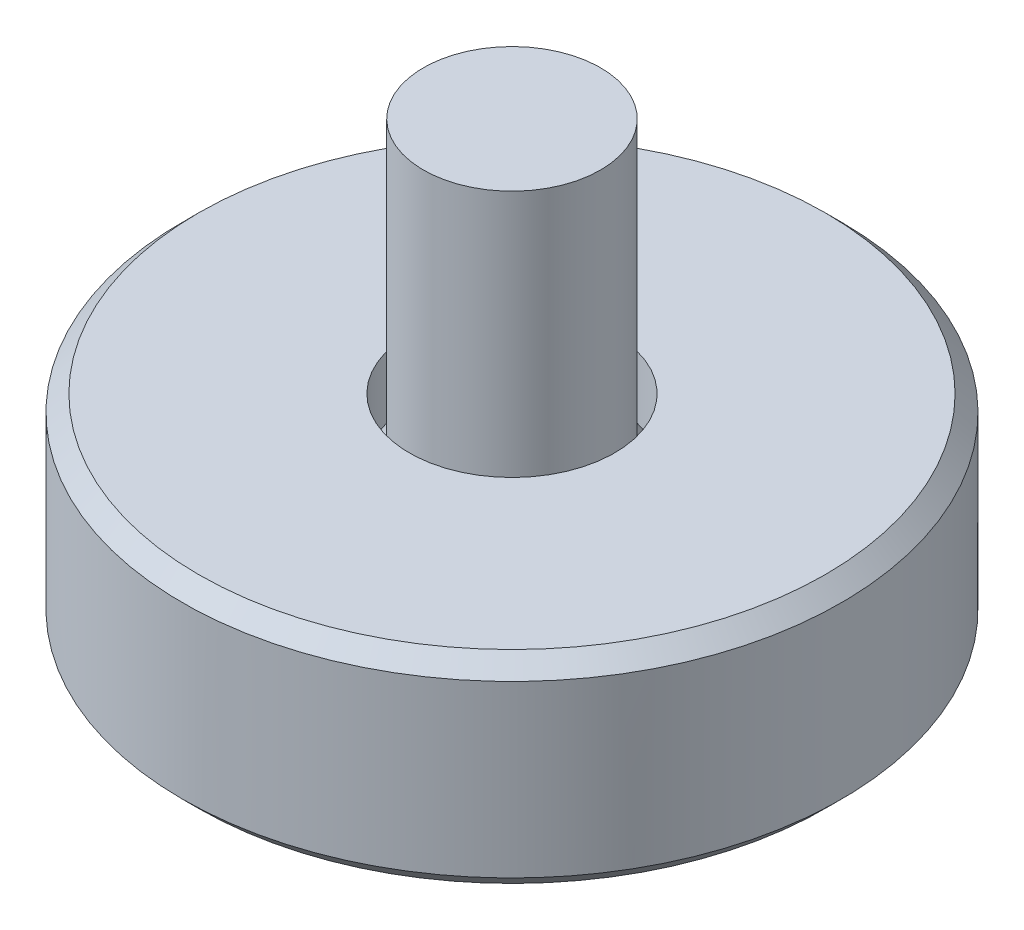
ISO-10303-21;
HEADER;
FILE_DESCRIPTION(('STEP AP214'),'2;1');
FILE_NAME('part.step','',(''),(''),'','','');
FILE_SCHEMA(('AUTOMOTIVE_DESIGN { 1 0 10303 214 1 1 1 1 }'));
ENDSEC;
DATA;
#1=APPLICATION_CONTEXT('core data for automotive mechanical design processes');
#2=APPLICATION_PROTOCOL_DEFINITION('international standard','automotive_design',2000,#1);
#3=PRODUCT_CONTEXT('',#1,'mechanical');
#4=PRODUCT('Part','Part','',(#3));
#5=PRODUCT_RELATED_PRODUCT_CATEGORY('part','',(#4));
#6=PRODUCT_DEFINITION_FORMATION('','',#4);
#7=PRODUCT_DEFINITION_CONTEXT('part definition',#1,'design');
#8=PRODUCT_DEFINITION('design','',#6,#7);
#9=PRODUCT_DEFINITION_SHAPE('','',#8);
#10=(LENGTH_UNIT() NAMED_UNIT(*) SI_UNIT(.MILLI.,.METRE.));
#11=(NAMED_UNIT(*) PLANE_ANGLE_UNIT() SI_UNIT($,.RADIAN.));
#12=(NAMED_UNIT(*) SI_UNIT($,.STERADIAN.) SOLID_ANGLE_UNIT());
#13=UNCERTAINTY_MEASURE_WITH_UNIT(LENGTH_MEASURE(1.E-05),#10,'distance_accuracy_value','');
#14=(GEOMETRIC_REPRESENTATION_CONTEXT(3) GLOBAL_UNCERTAINTY_ASSIGNED_CONTEXT((#13)) GLOBAL_UNIT_ASSIGNED_CONTEXT((#10,
#11,#12)) REPRESENTATION_CONTEXT('',''));
#15=CARTESIAN_POINT('',(0.,0.,0.));
#16=DIRECTION('',(0.,0.,1.));
#17=DIRECTION('',(1.,0.,0.));
#18=AXIS2_PLACEMENT_3D('',#15,#16,#17);
#19=CARTESIAN_POINT('',(0.,10.3579642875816,0.));
#20=DIRECTION('',(0.,1.,0.));
#21=DIRECTION('',(1.,0.,0.));
#22=AXIS2_PLACEMENT_3D('',#19,#20,#21);
#23=PLANE('',#22);
#24=CARTESIAN_POINT('',(0.,10.3579642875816,0.));
#25=DIRECTION('',(0.,1.,0.));
#26=DIRECTION('',(1.,0.,0.));
#27=AXIS2_PLACEMENT_3D('',#24,#25,#26);
#28=CIRCLE('',#27,2.0828);
#29=CARTESIAN_POINT('',(2.0828,10.3579642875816,0.));
#30=VERTEX_POINT('',#29);
#31=EDGE_CURVE('E12',#30,#30,#28,.T.);
#32=ORIENTED_EDGE('',*,*,#31,.T.);
#33=EDGE_LOOP('',(#32));
#34=FACE_BOUND('',#33,.T.);
#35=ADVANCED_FACE('F47',(#34),#23,.T.);
#36=CARTESIAN_POINT('',(0.,10.3579642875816,0.));
#37=DIRECTION('',(0.,1.,0.));
#38=DIRECTION('',(1.,0.,0.));
#39=AXIS2_PLACEMENT_3D('',#36,#37,#38);
#40=CYLINDRICAL_SURFACE('',#39,2.0828);
#41=CARTESIAN_POINT('',(0.,3.68185164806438,0.));
#42=DIRECTION('',(0.,1.,0.));
#43=DIRECTION('',(1.,0.,0.));
#44=AXIS2_PLACEMENT_3D('',#41,#42,#43);
#45=CIRCLE('',#44,2.0828);
#46=CARTESIAN_POINT('',(2.0828,3.68185164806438,0.));
#47=VERTEX_POINT('',#46);
#48=EDGE_CURVE('E54',#47,#47,#45,.T.);
#49=ORIENTED_EDGE('',*,*,#48,.T.);
#50=EDGE_LOOP('',(#49));
#51=FACE_BOUND('',#50,.T.);
#52=ORIENTED_EDGE('',*,*,#31,.F.);
#53=EDGE_LOOP('',(#52));
#54=FACE_BOUND('',#53,.T.);
#55=ADVANCED_FACE('F158',(#51,#54),#40,.T.);
#56=CARTESIAN_POINT('',(0.,3.68185164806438,0.));
#57=DIRECTION('',(0.,-1.,0.));
#58=DIRECTION('',(-1.,0.,0.));
#59=AXIS2_PLACEMENT_3D('',#56,#57,#58);
#60=CONICAL_SURFACE('',#59,2.0828,0.715584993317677);
#61=CARTESIAN_POINT('',(0.,0.832964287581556,0.));
#62=DIRECTION('',(0.,1.,0.));
#63=DIRECTION('',(1.,0.,0.));
#64=AXIS2_PLACEMENT_3D('',#61,#62,#63);
#65=CIRCLE('',#64,4.5593);
#66=CARTESIAN_POINT('',(4.5593,0.832964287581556,0.));
#67=VERTEX_POINT('',#66);
#68=EDGE_CURVE('E148',#67,#67,#65,.T.);
#69=ORIENTED_EDGE('',*,*,#68,.T.);
#70=EDGE_LOOP('',(#69));
#71=FACE_BOUND('',#70,.T.);
#72=ORIENTED_EDGE('',*,*,#48,.F.);
#73=EDGE_LOOP('',(#72));
#74=FACE_BOUND('',#73,.T.);
#75=ADVANCED_FACE('F161',(#71,#74),#60,.T.);
#76=CARTESIAN_POINT('',(0.,0.832964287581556,4.5593));
#77=DIRECTION('',(0.,-1.,0.));
#78=DIRECTION('',(-1.,0.,0.));
#79=AXIS2_PLACEMENT_3D('',#76,#77,#78);
#80=PLANE('',#79);
#81=DIRECTION('',(0.866025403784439,0.,0.5));
#82=VECTOR('',#81,1.);
#83=CARTESIAN_POINT('',(0.,0.832964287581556,-1.36381680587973));
#84=LINE('',#83,#82);
#85=CARTESIAN_POINT('',(0.,0.832964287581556,-1.36381680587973));
#86=VERTEX_POINT('',#85);
#87=CARTESIAN_POINT('',(1.1811,0.832964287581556,-0.681908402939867));
#88=VERTEX_POINT('',#87);
#89=EDGE_CURVE('E61',#86,#88,#84,.T.);
#90=ORIENTED_EDGE('',*,*,#89,.F.);
#91=DIRECTION('',(0.866025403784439,0.,-0.5));
#92=VECTOR('',#91,1.);
#93=CARTESIAN_POINT('',(-1.1811,0.832964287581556,-0.681908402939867));
#94=LINE('',#93,#92);
#95=CARTESIAN_POINT('',(-1.1811,0.832964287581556,-0.681908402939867));
#96=VERTEX_POINT('',#95);
#97=EDGE_CURVE('E144',#96,#86,#94,.T.);
#98=ORIENTED_EDGE('',*,*,#97,.F.);
#99=DIRECTION('',(0.,0.,-1.));
#100=VECTOR('',#99,1.);
#101=CARTESIAN_POINT('',(-1.1811,0.832964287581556,0.681908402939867));
#102=LINE('',#101,#100);
#103=CARTESIAN_POINT('',(-1.1811,0.832964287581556,0.681908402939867));
#104=VERTEX_POINT('',#103);
#105=EDGE_CURVE('E142',#104,#96,#102,.T.);
#106=ORIENTED_EDGE('',*,*,#105,.F.);
#107=DIRECTION('',(-0.866025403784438,0.,-0.5));
#108=VECTOR('',#107,1.);
#109=CARTESIAN_POINT('',(0.,0.832964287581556,1.36381680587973));
#110=LINE('',#109,#108);
#111=CARTESIAN_POINT('',(0.,0.832964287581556,1.36381680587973));
#112=VERTEX_POINT('',#111);
#113=EDGE_CURVE('E109',#112,#104,#110,.T.);
#114=ORIENTED_EDGE('',*,*,#113,.F.);
#115=DIRECTION('',(-0.866025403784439,0.,0.5));
#116=VECTOR('',#115,1.);
#117=CARTESIAN_POINT('',(1.1811,0.832964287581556,0.681908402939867));
#118=LINE('',#117,#116);
#119=CARTESIAN_POINT('',(1.1811,0.832964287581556,0.681908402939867));
#120=VERTEX_POINT('',#119);
#121=EDGE_CURVE('E138',#120,#112,#118,.T.);
#122=ORIENTED_EDGE('',*,*,#121,.F.);
#123=DIRECTION('',(0.,0.,1.));
#124=VECTOR('',#123,1.);
#125=CARTESIAN_POINT('',(1.1811,0.832964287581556,-0.681908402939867));
#126=LINE('',#125,#124);
#127=EDGE_CURVE('E135',#88,#120,#126,.T.);
#128=ORIENTED_EDGE('',*,*,#127,.F.);
#129=EDGE_LOOP('',(#90,#98,#106,#114,#122,#128));
#130=FACE_BOUND('',#129,.T.);
#131=ORIENTED_EDGE('',*,*,#68,.F.);
#132=EDGE_LOOP('',(#131));
#133=FACE_BOUND('',#132,.T.);
#134=ADVANCED_FACE('F163',(#130,#133),#80,.T.);
#135=CARTESIAN_POINT('',(0.,3.62696428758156,-1.36381680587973));
#136=DIRECTION('',(0.5,0.,-0.866025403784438));
#137=DIRECTION('',(-0.866025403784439,0.,-0.5));
#138=AXIS2_PLACEMENT_3D('',#135,#136,#137);
#139=PLANE('',#138);
#140=ORIENTED_EDGE('',*,*,#89,.T.);
#141=DIRECTION('',(0.,-1.,0.));
#142=VECTOR('',#141,1.);
#143=CARTESIAN_POINT('',(1.1811,3.62696428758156,-0.681908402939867));
#144=LINE('',#143,#142);
#145=CARTESIAN_POINT('',(1.1811,3.62696428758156,-0.681908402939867));
#146=VERTEX_POINT('',#145);
#147=EDGE_CURVE('E91',#146,#88,#144,.T.);
#148=ORIENTED_EDGE('',*,*,#147,.F.);
#149=DIRECTION('',(0.866025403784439,0.,0.5));
#150=VECTOR('',#149,1.);
#151=CARTESIAN_POINT('',(0.,3.62696428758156,-1.36381680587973));
#152=LINE('',#151,#150);
#153=CARTESIAN_POINT('',(0.,3.62696428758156,-1.36381680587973));
#154=VERTEX_POINT('',#153);
#155=EDGE_CURVE('E146',#154,#146,#152,.T.);
#156=ORIENTED_EDGE('',*,*,#155,.F.);
#157=DIRECTION('',(0.,-1.,0.));
#158=VECTOR('',#157,1.);
#159=CARTESIAN_POINT('',(0.,3.62696428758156,-1.36381680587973));
#160=LINE('',#159,#158);
#161=EDGE_CURVE('E69',#154,#86,#160,.T.);
#162=ORIENTED_EDGE('',*,*,#161,.T.);
#163=EDGE_LOOP('',(#140,#148,#156,#162));
#164=FACE_BOUND('',#163,.T.);
#165=ADVANCED_FACE('F170',(#164),#139,.F.);
#166=CARTESIAN_POINT('',(-1.1811,3.62696428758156,-0.681908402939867));
#167=DIRECTION('',(-0.5,0.,-0.866025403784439));
#168=DIRECTION('',(-0.866025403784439,0.,0.5));
#169=AXIS2_PLACEMENT_3D('',#166,#167,#168);
#170=PLANE('',#169);
#171=ORIENTED_EDGE('',*,*,#97,.T.);
#172=ORIENTED_EDGE('',*,*,#161,.F.);
#173=DIRECTION('',(0.866025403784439,0.,-0.5));
#174=VECTOR('',#173,1.);
#175=CARTESIAN_POINT('',(-1.1811,3.62696428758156,-0.681908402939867));
#176=LINE('',#175,#174);
#177=CARTESIAN_POINT('',(-1.1811,3.62696428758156,-0.681908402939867));
#178=VERTEX_POINT('',#177);
#179=EDGE_CURVE('E121',#178,#154,#176,.T.);
#180=ORIENTED_EDGE('',*,*,#179,.F.);
#181=DIRECTION('',(0.,-1.,0.));
#182=VECTOR('',#181,1.);
#183=CARTESIAN_POINT('',(-1.1811,3.62696428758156,-0.681908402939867));
#184=LINE('',#183,#182);
#185=EDGE_CURVE('E113',#178,#96,#184,.T.);
#186=ORIENTED_EDGE('',*,*,#185,.T.);
#187=EDGE_LOOP('',(#171,#172,#180,#186));
#188=FACE_BOUND('',#187,.T.);
#189=ADVANCED_FACE('F201',(#188),#170,.F.);
#190=CARTESIAN_POINT('',(-1.1811,3.62696428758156,0.681908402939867));
#191=DIRECTION('',(-1.,0.,0.));
#192=DIRECTION('',(0.,0.,1.));
#193=AXIS2_PLACEMENT_3D('',#190,#191,#192);
#194=PLANE('',#193);
#195=ORIENTED_EDGE('',*,*,#105,.T.);
#196=ORIENTED_EDGE('',*,*,#185,.F.);
#197=DIRECTION('',(0.,0.,-1.));
#198=VECTOR('',#197,1.);
#199=CARTESIAN_POINT('',(-1.1811,3.62696428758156,0.681908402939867));
#200=LINE('',#199,#198);
#201=CARTESIAN_POINT('',(-1.1811,3.62696428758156,0.681908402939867));
#202=VERTEX_POINT('',#201);
#203=EDGE_CURVE('E117',#202,#178,#200,.T.);
#204=ORIENTED_EDGE('',*,*,#203,.F.);
#205=DIRECTION('',(0.,-1.,0.));
#206=VECTOR('',#205,1.);
#207=CARTESIAN_POINT('',(-1.1811,3.62696428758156,0.681908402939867));
#208=LINE('',#207,#206);
#209=EDGE_CURVE('E102',#202,#104,#208,.T.);
#210=ORIENTED_EDGE('',*,*,#209,.T.);
#211=EDGE_LOOP('',(#195,#196,#204,#210));
#212=FACE_BOUND('',#211,.T.);
#213=ADVANCED_FACE('F118',(#212),#194,.F.);
#214=CARTESIAN_POINT('',(0.,3.62696428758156,1.36381680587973));
#215=DIRECTION('',(-0.5,0.,0.866025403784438));
#216=DIRECTION('',(0.866025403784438,0.,0.5));
#217=AXIS2_PLACEMENT_3D('',#214,#215,#216);
#218=PLANE('',#217);
#219=ORIENTED_EDGE('',*,*,#113,.T.);
#220=ORIENTED_EDGE('',*,*,#209,.F.);
#221=DIRECTION('',(-0.866025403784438,0.,-0.5));
#222=VECTOR('',#221,1.);
#223=CARTESIAN_POINT('',(0.,3.62696428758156,1.36381680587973));
#224=LINE('',#223,#222);
#225=CARTESIAN_POINT('',(0.,3.62696428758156,1.36381680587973));
#226=VERTEX_POINT('',#225);
#227=EDGE_CURVE('E106',#226,#202,#224,.T.);
#228=ORIENTED_EDGE('',*,*,#227,.F.);
#229=DIRECTION('',(0.,-1.,0.));
#230=VECTOR('',#229,1.);
#231=CARTESIAN_POINT('',(0.,3.62696428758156,1.36381680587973));
#232=LINE('',#231,#230);
#233=EDGE_CURVE('E114',#226,#112,#232,.T.);
#234=ORIENTED_EDGE('',*,*,#233,.T.);
#235=EDGE_LOOP('',(#219,#220,#228,#234));
#236=FACE_BOUND('',#235,.T.);
#237=ADVANCED_FACE('F104',(#236),#218,.F.);
#238=CARTESIAN_POINT('',(1.1811,3.62696428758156,0.681908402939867));
#239=DIRECTION('',(0.5,0.,0.866025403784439));
#240=DIRECTION('',(0.866025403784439,0.,-0.5));
#241=AXIS2_PLACEMENT_3D('',#238,#239,#240);
#242=PLANE('',#241);
#243=ORIENTED_EDGE('',*,*,#121,.T.);
#244=ORIENTED_EDGE('',*,*,#233,.F.);
#245=DIRECTION('',(-0.866025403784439,0.,0.5));
#246=VECTOR('',#245,1.);
#247=CARTESIAN_POINT('',(1.1811,3.62696428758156,0.681908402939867));
#248=LINE('',#247,#246);
#249=CARTESIAN_POINT('',(1.1811,3.62696428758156,0.681908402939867));
#250=VERTEX_POINT('',#249);
#251=EDGE_CURVE('E127',#250,#226,#248,.T.);
#252=ORIENTED_EDGE('',*,*,#251,.F.);
#253=DIRECTION('',(0.,-1.,0.));
#254=VECTOR('',#253,1.);
#255=CARTESIAN_POINT('',(1.1811,3.62696428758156,0.681908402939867));
#256=LINE('',#255,#254);
#257=EDGE_CURVE('E151',#250,#120,#256,.T.);
#258=ORIENTED_EDGE('',*,*,#257,.T.);
#259=EDGE_LOOP('',(#243,#244,#252,#258));
#260=FACE_BOUND('',#259,.T.);
#261=ADVANCED_FACE('F226',(#260),#242,.F.);
#262=CARTESIAN_POINT('',(1.1811,3.62696428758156,-0.681908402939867));
#263=DIRECTION('',(1.,0.,0.));
#264=DIRECTION('',(0.,-1.,0.));
#265=AXIS2_PLACEMENT_3D('',#262,#263,#264);
#266=PLANE('',#265);
#267=ORIENTED_EDGE('',*,*,#127,.T.);
#268=ORIENTED_EDGE('',*,*,#257,.F.);
#269=DIRECTION('',(0.,0.,1.));
#270=VECTOR('',#269,1.);
#271=CARTESIAN_POINT('',(1.1811,3.62696428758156,-0.681908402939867));
#272=LINE('',#271,#270);
#273=EDGE_CURVE('E129',#146,#250,#272,.T.);
#274=ORIENTED_EDGE('',*,*,#273,.F.);
#275=ORIENTED_EDGE('',*,*,#147,.T.);
#276=EDGE_LOOP('',(#267,#268,#274,#275));
#277=FACE_BOUND('',#276,.T.);
#278=ADVANCED_FACE('F235',(#277),#266,.F.);
#279=CARTESIAN_POINT('',(2.3622,3.62696428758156,0.));
#280=DIRECTION('',(0.,-1.,0.));
#281=DIRECTION('',(-1.,0.,0.));
#282=AXIS2_PLACEMENT_3D('',#279,#280,#281);
#283=PLANE('',#282);
#284=ORIENTED_EDGE('',*,*,#155,.T.);
#285=ORIENTED_EDGE('',*,*,#273,.T.);
#286=ORIENTED_EDGE('',*,*,#251,.T.);
#287=ORIENTED_EDGE('',*,*,#227,.T.);
#288=ORIENTED_EDGE('',*,*,#203,.T.);
#289=ORIENTED_EDGE('',*,*,#179,.T.);
#290=EDGE_LOOP('',(#284,#285,#286,#287,#288,#289));
#291=FACE_BOUND('',#290,.T.);
#292=ADVANCED_FACE('F124',(#291),#283,.T.);
#293=CLOSED_SHELL('',(#35,#55,#75,#134,#165,#189,#213,#237,#261,#278,#292));
#294=MANIFOLD_SOLID_BREP('B2',#293);
#295=CARTESIAN_POINT('',(0.,4.7625,0.));
#296=DIRECTION('',(0.,-1.,0.));
#297=DIRECTION('',(0.,0.,-1.));
#298=AXIS2_PLACEMENT_3D('',#295,#296,#297);
#299=CYLINDRICAL_SURFACE('',#298,7.747);
#300=CARTESIAN_POINT('',(0.,0.381000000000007,0.));
#301=DIRECTION('',(0.,1.,0.));
#302=DIRECTION('',(0.,0.,1.));
#303=AXIS2_PLACEMENT_3D('',#300,#301,#302);
#304=CIRCLE('',#303,7.747);
#305=CARTESIAN_POINT('',(0.,0.381000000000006,-7.747));
#306=VERTEX_POINT('',#305);
#307=EDGE_CURVE('E278',#306,#306,#304,.T.);
#308=CARTESIAN_POINT('',(0.,4.38150000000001,0.));
#309=DIRECTION('',(0.,1.,0.));
#310=DIRECTION('',(0.,0.,1.));
#311=AXIS2_PLACEMENT_3D('',#308,#309,#310);
#312=CIRCLE('',#311,7.747);
#313=CARTESIAN_POINT('',(0.,4.38150000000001,-7.747));
#314=VERTEX_POINT('',#313);
#315=EDGE_CURVE('E282',#314,#314,#312,.F.);
#316=CARTESIAN_POINT('',(0.,0.381000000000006,-7.747));
#317=CARTESIAN_POINT('',(0.,0.422671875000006,-7.747));
#318=CARTESIAN_POINT('',(0.,0.464343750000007,-7.747));
#319=CARTESIAN_POINT('',(0.,0.547687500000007,-7.747));
#320=CARTESIAN_POINT('',(0.,0.589359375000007,-7.747));
#321=CARTESIAN_POINT('',(0.,0.672703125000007,-7.747));
#322=CARTESIAN_POINT('',(0.,0.714375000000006,-7.747));
#323=CARTESIAN_POINT('',(0.,0.797718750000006,-7.747));
#324=CARTESIAN_POINT('',(0.,0.839390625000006,-7.747));
#325=CARTESIAN_POINT('',(0.,0.922734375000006,-7.747));
#326=CARTESIAN_POINT('',(0.,0.964406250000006,-7.747));
#327=CARTESIAN_POINT('',(0.,1.04775000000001,-7.747));
#328=CARTESIAN_POINT('',(0.,1.08942187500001,-7.747));
#329=CARTESIAN_POINT('',(0.,1.17276562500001,-7.747));
#330=CARTESIAN_POINT('',(0.,1.21443750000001,-7.747));
#331=CARTESIAN_POINT('',(0.,1.29778125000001,-7.747));
#332=CARTESIAN_POINT('',(0.,1.33945312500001,-7.747));
#333=CARTESIAN_POINT('',(0.,1.42279687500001,-7.747));
#334=CARTESIAN_POINT('',(0.,1.46446875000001,-7.747));
#335=CARTESIAN_POINT('',(0.,1.54781250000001,-7.747));
#336=CARTESIAN_POINT('',(0.,1.58948437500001,-7.747));
#337=CARTESIAN_POINT('',(0.,1.67282812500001,-7.747));
#338=CARTESIAN_POINT('',(0.,1.71450000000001,-7.747));
#339=CARTESIAN_POINT('',(0.,1.79784375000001,-7.747));
#340=CARTESIAN_POINT('',(0.,1.83951562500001,-7.747));
#341=CARTESIAN_POINT('',(0.,1.92285937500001,-7.747));
#342=CARTESIAN_POINT('',(0.,1.96453125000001,-7.747));
#343=CARTESIAN_POINT('',(0.,2.04787500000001,-7.747));
#344=CARTESIAN_POINT('',(0.,2.08954687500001,-7.747));
#345=CARTESIAN_POINT('',(0.,2.17289062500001,-7.747));
#346=CARTESIAN_POINT('',(0.,2.21456250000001,-7.747));
#347=CARTESIAN_POINT('',(0.,2.29790625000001,-7.747));
#348=CARTESIAN_POINT('',(0.,2.33957812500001,-7.747));
#349=CARTESIAN_POINT('',(0.,2.42292187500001,-7.747));
#350=CARTESIAN_POINT('',(0.,2.46459375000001,-7.747));
#351=CARTESIAN_POINT('',(0.,2.54793750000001,-7.747));
#352=CARTESIAN_POINT('',(0.,2.58960937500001,-7.747));
#353=CARTESIAN_POINT('',(0.,2.67295312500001,-7.747));
#354=CARTESIAN_POINT('',(0.,2.71462500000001,-7.747));
#355=CARTESIAN_POINT('',(0.,2.79796875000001,-7.747));
#356=CARTESIAN_POINT('',(0.,2.83964062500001,-7.747));
#357=CARTESIAN_POINT('',(0.,2.92298437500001,-7.747));
#358=CARTESIAN_POINT('',(0.,2.96465625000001,-7.747));
#359=CARTESIAN_POINT('',(0.,3.04800000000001,-7.747));
#360=CARTESIAN_POINT('',(0.,3.08967187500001,-7.747));
#361=CARTESIAN_POINT('',(0.,3.17301562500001,-7.747));
#362=CARTESIAN_POINT('',(0.,3.21468750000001,-7.747));
#363=CARTESIAN_POINT('',(0.,3.29803125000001,-7.747));
#364=CARTESIAN_POINT('',(0.,3.33970312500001,-7.747));
#365=CARTESIAN_POINT('',(0.,3.42304687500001,-7.747));
#366=CARTESIAN_POINT('',(0.,3.46471875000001,-7.747));
#367=CARTESIAN_POINT('',(0.,3.54806250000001,-7.747));
#368=CARTESIAN_POINT('',(0.,3.58973437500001,-7.747));
#369=CARTESIAN_POINT('',(0.,3.67307812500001,-7.747));
#370=CARTESIAN_POINT('',(0.,3.71475000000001,-7.747));
#371=CARTESIAN_POINT('',(0.,3.79809375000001,-7.747));
#372=CARTESIAN_POINT('',(0.,3.83976562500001,-7.747));
#373=CARTESIAN_POINT('',(0.,3.92310937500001,-7.747));
#374=CARTESIAN_POINT('',(0.,3.96478125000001,-7.747));
#375=CARTESIAN_POINT('',(0.,4.04812500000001,-7.747));
#376=CARTESIAN_POINT('',(0.,4.08979687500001,-7.747));
#377=CARTESIAN_POINT('',(0.,4.17314062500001,-7.747));
#378=CARTESIAN_POINT('',(0.,4.21481250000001,-7.747));
#379=CARTESIAN_POINT('',(0.,4.29815625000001,-7.747));
#380=CARTESIAN_POINT('',(0.,4.33982812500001,-7.747));
#381=CARTESIAN_POINT('',(0.,4.38150000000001,-7.747));
#382=B_SPLINE_CURVE_WITH_KNOTS('',3,(#316,#317,#318,#319,#320,#321,#322,#323,#324,#325,#326,
#327,#328,#329,#330,#331,#332,#333,#334,#335,#336,#337,#338,#339,#340,#341,#342,#343,#344,#345,
#346,#347,#348,#349,#350,#351,#352,#353,#354,#355,#356,#357,#358,#359,#360,#361,#362,#363,#364,
#365,#366,#367,#368,#369,#370,#371,#372,#373,#374,#375,#376,#377,#378,#379,#380,#381),
.UNSPECIFIED.,.F.,.F.,(4,2,2,2,2,2,2,2,2,2,2,2,2,2,2,2,2,2,2,2,2,2,2,2,2,2,2,2,2,2,2,2,4),(0.,
0.125015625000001,0.25003125,0.375046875,0.5000625,0.625078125,0.75009375,0.875109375,1.000125,
1.125140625,1.25015625,1.375171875,1.5001875,1.625203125,1.75021875,1.875234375,2.00025,
2.125265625,2.25028125,2.375296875,2.5003125,2.625328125,2.75034375,2.875359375,3.000375,
3.125390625,3.25040625,3.375421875,3.5004375,3.625453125,3.75046875,3.875484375,4.0005),.UNSPECIFIED.);
#383=EDGE_CURVE('BSEAM267',#306,#314,#382,.T.);
#384=ORIENTED_EDGE('',*,*,#307,.T.);
#385=ORIENTED_EDGE('',*,*,#315,.T.);
#386=ORIENTED_EDGE('',*,*,#383,.T.);
#387=ORIENTED_EDGE('',*,*,#383,.F.);
#388=EDGE_LOOP('',(#384,#386,#385,#387));
#389=FACE_BOUND('',#388,.T.);
#390=ADVANCED_FACE('F267',(#389),#299,.T.);
#391=CARTESIAN_POINT('',(0.,4.7625,0.));
#392=DIRECTION('',(0.,1.,0.));
#393=DIRECTION('',(0.,0.,1.));
#394=AXIS2_PLACEMENT_3D('',#391,#392,#393);
#395=PLANE('',#394);
#396=CARTESIAN_POINT('',(0.,4.7625,0.));
#397=DIRECTION('',(0.,-1.,0.));
#398=DIRECTION('',(0.,0.,-1.));
#399=AXIS2_PLACEMENT_3D('',#396,#397,#398);
#400=CIRCLE('',#399,2.413);
#401=CARTESIAN_POINT('',(0.,4.7625,-2.413));
#402=VERTEX_POINT('',#401);
#403=EDGE_CURVE('E293',#402,#402,#400,.T.);
#404=ORIENTED_EDGE('',*,*,#403,.T.);
#405=EDGE_LOOP('',(#404));
#406=FACE_BOUND('',#405,.T.);
#407=CARTESIAN_POINT('',(0.,4.7625,0.));
#408=DIRECTION('',(0.,1.,0.));
#409=DIRECTION('',(0.,0.,1.));
#410=AXIS2_PLACEMENT_3D('',#407,#408,#409);
#411=CIRCLE('',#410,7.36600000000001);
#412=CARTESIAN_POINT('',(0.,4.7625,7.36600000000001));
#413=VERTEX_POINT('',#412);
#414=EDGE_CURVE('E46',#413,#413,#411,.T.);
#415=ORIENTED_EDGE('',*,*,#414,.T.);
#416=EDGE_LOOP('',(#415));
#417=FACE_BOUND('',#416,.T.);
#418=ADVANCED_FACE('F297',(#406,#417),#395,.T.);
#419=CARTESIAN_POINT('',(0.,0.,0.));
#420=DIRECTION('',(0.,1.,0.));
#421=DIRECTION('',(0.,0.,1.));
#422=AXIS2_PLACEMENT_3D('',#419,#420,#421);
#423=PLANE('',#422);
#424=CARTESIAN_POINT('',(0.,0.,0.));
#425=DIRECTION('',(0.,-1.,0.));
#426=DIRECTION('',(0.,0.,-1.));
#427=AXIS2_PLACEMENT_3D('',#424,#425,#426);
#428=CIRCLE('',#427,5.28338480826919);
#429=CARTESIAN_POINT('',(0.,0.,-5.28338480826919));
#430=VERTEX_POINT('',#429);
#431=EDGE_CURVE('E287',#430,#430,#428,.T.);
#432=ORIENTED_EDGE('',*,*,#431,.F.);
#433=EDGE_LOOP('',(#432));
#434=FACE_BOUND('',#433,.T.);
#435=CARTESIAN_POINT('',(0.,0.,0.));
#436=DIRECTION('',(0.,1.,0.));
#437=DIRECTION('',(0.,0.,1.));
#438=AXIS2_PLACEMENT_3D('',#435,#436,#437);
#439=CIRCLE('',#438,7.36599999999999);
#440=CARTESIAN_POINT('',(0.,0.,7.36599999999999));
#441=VERTEX_POINT('',#440);
#442=EDGE_CURVE('E274',#441,#441,#439,.F.);
#443=ORIENTED_EDGE('',*,*,#442,.T.);
#444=EDGE_LOOP('',(#443));
#445=FACE_BOUND('',#444,.T.);
#446=ADVANCED_FACE('F311',(#434,#445),#423,.F.);
#447=CARTESIAN_POINT('',(0.,0.381000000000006,0.));
#448=DIRECTION('',(0.,1.,0.));
#449=DIRECTION('',(0.,0.,1.));
#450=AXIS2_PLACEMENT_3D('',#447,#448,#449);
#451=CONICAL_SURFACE('',#450,7.747,0.785398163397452);
#452=ORIENTED_EDGE('',*,*,#442,.F.);
#453=EDGE_LOOP('',(#452));
#454=FACE_BOUND('',#453,.T.);
#455=ORIENTED_EDGE('',*,*,#307,.F.);
#456=EDGE_LOOP('',(#455));
#457=FACE_BOUND('',#456,.T.);
#458=ADVANCED_FACE('F313',(#454,#457),#451,.T.);
#459=CARTESIAN_POINT('',(0.,4.7625,0.));
#460=DIRECTION('',(0.,-1.,0.));
#461=DIRECTION('',(0.,0.,-1.));
#462=AXIS2_PLACEMENT_3D('',#459,#460,#461);
#463=CONICAL_SURFACE('',#462,7.36600000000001,0.785398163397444);
#464=ORIENTED_EDGE('',*,*,#315,.F.);
#465=EDGE_LOOP('',(#464));
#466=FACE_BOUND('',#465,.T.);
#467=ORIENTED_EDGE('',*,*,#414,.F.);
#468=EDGE_LOOP('',(#467));
#469=FACE_BOUND('',#468,.T.);
#470=ADVANCED_FACE('F269',(#466,#469),#463,.T.);
#471=CARTESIAN_POINT('',(0.,0.,0.));
#472=DIRECTION('',(0.,-1.,0.));
#473=DIRECTION('',(0.,0.,-1.));
#474=AXIS2_PLACEMENT_3D('',#471,#472,#473);
#475=CONICAL_SURFACE('',#474,5.28338480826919,0.715584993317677);
#476=CARTESIAN_POINT('',(0.,3.302,0.));
#477=DIRECTION('',(0.,-1.,0.));
#478=DIRECTION('',(0.,0.,-1.));
#479=AXIS2_PLACEMENT_3D('',#476,#477,#478);
#480=CIRCLE('',#479,2.413);
#481=CARTESIAN_POINT('',(0.,3.302,-2.413));
#482=VERTEX_POINT('',#481);
#483=EDGE_CURVE('E290',#482,#482,#480,.T.);
#484=ORIENTED_EDGE('',*,*,#483,.F.);
#485=EDGE_LOOP('',(#484));
#486=FACE_BOUND('',#485,.T.);
#487=ORIENTED_EDGE('',*,*,#431,.T.);
#488=EDGE_LOOP('',(#487));
#489=FACE_BOUND('',#488,.T.);
#490=ADVANCED_FACE('F302',(#486,#489),#475,.F.);
#491=CARTESIAN_POINT('',(0.,-2.0500103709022,0.));
#492=DIRECTION('',(0.,-1.,0.));
#493=DIRECTION('',(0.,0.,-1.));
#494=AXIS2_PLACEMENT_3D('',#491,#492,#493);
#495=CYLINDRICAL_SURFACE('',#494,2.413);
#496=ORIENTED_EDGE('',*,*,#403,.F.);
#497=EDGE_LOOP('',(#496));
#498=FACE_BOUND('',#497,.T.);
#499=ORIENTED_EDGE('',*,*,#483,.T.);
#500=EDGE_LOOP('',(#499));
#501=FACE_BOUND('',#500,.T.);
#502=ADVANCED_FACE('F299',(#498,#501),#495,.F.);
#503=CLOSED_SHELL('',(#390,#418,#446,#458,#470,#490,#502));
#504=MANIFOLD_SOLID_BREP('B6',#503);
#505=ADVANCED_BREP_SHAPE_REPRESENTATION('',(#18,#294,#504),#14);
#506=SHAPE_DEFINITION_REPRESENTATION(#9,#505);
ENDSEC;
END-ISO-10303-21;
